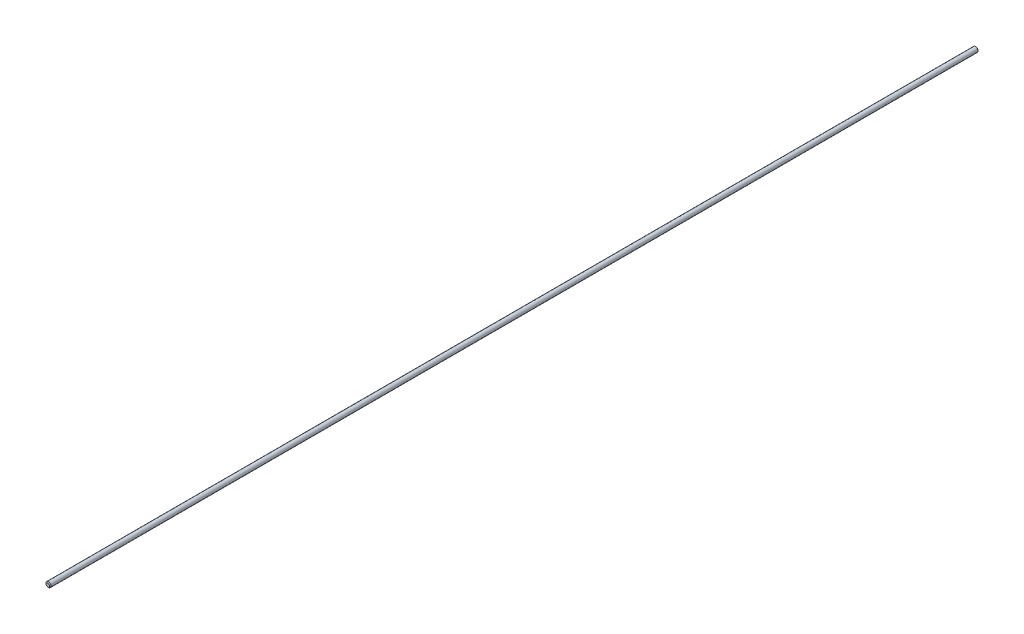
ISO-10303-21;
HEADER;
FILE_DESCRIPTION(('STEP AP214'),'2;1');
FILE_NAME('part.step','',(''),(''),'','','');
FILE_SCHEMA(('AUTOMOTIVE_DESIGN { 1 0 10303 214 1 1 1 1 }'));
ENDSEC;
DATA;
#1=APPLICATION_CONTEXT('core data for automotive mechanical design processes');
#2=APPLICATION_PROTOCOL_DEFINITION('international standard','automotive_design',2000,#1);
#3=PRODUCT_CONTEXT('',#1,'mechanical');
#4=PRODUCT('Part','Part','',(#3));
#5=PRODUCT_RELATED_PRODUCT_CATEGORY('part','',(#4));
#6=PRODUCT_DEFINITION_FORMATION('','',#4);
#7=PRODUCT_DEFINITION_CONTEXT('part definition',#1,'design');
#8=PRODUCT_DEFINITION('design','',#6,#7);
#9=PRODUCT_DEFINITION_SHAPE('','',#8);
#10=(LENGTH_UNIT() NAMED_UNIT(*) SI_UNIT(.MILLI.,.METRE.));
#11=(NAMED_UNIT(*) PLANE_ANGLE_UNIT() SI_UNIT($,.RADIAN.));
#12=(NAMED_UNIT(*) SI_UNIT($,.STERADIAN.) SOLID_ANGLE_UNIT());
#13=UNCERTAINTY_MEASURE_WITH_UNIT(LENGTH_MEASURE(1.E-05),#10,'distance_accuracy_value','');
#14=(GEOMETRIC_REPRESENTATION_CONTEXT(3) GLOBAL_UNCERTAINTY_ASSIGNED_CONTEXT((#13)) GLOBAL_UNIT_ASSIGNED_CONTEXT((#10,
#11,#12)) REPRESENTATION_CONTEXT('',''));
#15=CARTESIAN_POINT('',(0.,0.,0.));
#16=DIRECTION('',(0.,0.,1.));
#17=DIRECTION('',(1.,0.,0.));
#18=AXIS2_PLACEMENT_3D('',#15,#16,#17);
#19=CARTESIAN_POINT('',(0.,0.,584.2));
#20=DIRECTION('',(0.,0.,-1.));
#21=DIRECTION('',(-1.,0.,0.));
#22=AXIS2_PLACEMENT_3D('',#19,#20,#21);
#23=CYLINDRICAL_SURFACE('',#22,3.175);
#24=CARTESIAN_POINT('',(0.,0.,-583.2475));
#25=DIRECTION('',(0.,0.,1.));
#26=DIRECTION('',(1.,0.,0.));
#27=AXIS2_PLACEMENT_3D('',#24,#25,#26);
#28=CIRCLE('',#27,3.175);
#29=CARTESIAN_POINT('',(3.17499999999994,0.,-583.2475));
#30=VERTEX_POINT('',#29);
#31=EDGE_CURVE('E59',#30,#30,#28,.T.);
#32=ORIENTED_EDGE('',*,*,#31,.T.);
#33=EDGE_LOOP('',(#32));
#34=FACE_BOUND('',#33,.T.);
#35=CARTESIAN_POINT('',(0.,0.,583.2475));
#36=DIRECTION('',(0.,0.,1.));
#37=DIRECTION('',(1.,0.,0.));
#38=AXIS2_PLACEMENT_3D('',#35,#36,#37);
#39=CIRCLE('',#38,3.175);
#40=CARTESIAN_POINT('',(3.175,0.,583.2475));
#41=VERTEX_POINT('',#40);
#42=EDGE_CURVE('E62',#41,#41,#39,.F.);
#43=ORIENTED_EDGE('',*,*,#42,.T.);
#44=EDGE_LOOP('',(#43));
#45=FACE_BOUND('',#44,.T.);
#46=ADVANCED_FACE('F44',(#34,#45),#23,.T.);
#47=CARTESIAN_POINT('',(0.,0.,584.2));
#48=DIRECTION('',(0.,0.,1.));
#49=DIRECTION('',(1.,0.,0.));
#50=AXIS2_PLACEMENT_3D('',#47,#48,#49);
#51=PLANE('',#50);
#52=CARTESIAN_POINT('',(0.,0.,584.2));
#53=DIRECTION('',(0.,0.,1.));
#54=DIRECTION('',(1.,0.,0.));
#55=AXIS2_PLACEMENT_3D('',#52,#53,#54);
#56=CIRCLE('',#55,2.22249999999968);
#57=CARTESIAN_POINT('',(2.22249999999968,0.,584.2));
#58=VERTEX_POINT('',#57);
#59=EDGE_CURVE('E10',#58,#58,#56,.T.);
#60=ORIENTED_EDGE('',*,*,#59,.T.);
#61=EDGE_LOOP('',(#60));
#62=FACE_BOUND('',#61,.T.);
#63=ADVANCED_FACE('F78',(#62),#51,.T.);
#64=CARTESIAN_POINT('',(0.,0.,-584.2));
#65=DIRECTION('',(0.,0.,1.));
#66=DIRECTION('',(1.,0.,0.));
#67=AXIS2_PLACEMENT_3D('',#64,#65,#66);
#68=PLANE('',#67);
#69=CARTESIAN_POINT('',(0.,0.,-584.2));
#70=DIRECTION('',(0.,0.,1.));
#71=DIRECTION('',(1.,0.,0.));
#72=AXIS2_PLACEMENT_3D('',#69,#70,#71);
#73=CIRCLE('',#72,2.22249999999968);
#74=CARTESIAN_POINT('',(2.22249999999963,0.,-584.2));
#75=VERTEX_POINT('',#74);
#76=EDGE_CURVE('E52',#75,#75,#73,.F.);
#77=ORIENTED_EDGE('',*,*,#76,.T.);
#78=EDGE_LOOP('',(#77));
#79=FACE_BOUND('',#78,.T.);
#80=ADVANCED_FACE('F80',(#79),#68,.F.);
#81=CARTESIAN_POINT('',(0.,0.,-583.2475));
#82=DIRECTION('',(0.,0.,1.));
#83=DIRECTION('',(1.,0.,0.));
#84=AXIS2_PLACEMENT_3D('',#81,#82,#83);
#85=CONICAL_SURFACE('',#84,3.175,0.785398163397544);
#86=CARTESIAN_POINT('',(2.22249999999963,0.,-584.2));
#87=CARTESIAN_POINT('',(2.23242187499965,0.,-584.190078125));
#88=CARTESIAN_POINT('',(2.24234374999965,0.,-584.18015625));
#89=CARTESIAN_POINT('',(2.26218749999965,0.,-584.1603125));
#90=CARTESIAN_POINT('',(2.27210937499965,0.,-584.150390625));
#91=CARTESIAN_POINT('',(2.29195312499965,0.,-584.130546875));
#92=CARTESIAN_POINT('',(2.30187499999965,0.,-584.120625));
#93=CARTESIAN_POINT('',(2.32171874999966,0.,-584.10078125));
#94=CARTESIAN_POINT('',(2.33164062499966,0.,-584.090859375));
#95=CARTESIAN_POINT('',(2.35148437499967,0.,-584.071015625));
#96=CARTESIAN_POINT('',(2.36140624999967,0.,-584.06109375));
#97=CARTESIAN_POINT('',(2.38124999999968,0.,-584.04125));
#98=CARTESIAN_POINT('',(2.39117187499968,0.,-584.031328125));
#99=CARTESIAN_POINT('',(2.41101562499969,0.,-584.011484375));
#100=CARTESIAN_POINT('',(2.42093749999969,0.,-584.0015625));
#101=CARTESIAN_POINT('',(2.4407812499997,0.,-583.98171875));
#102=CARTESIAN_POINT('',(2.4507031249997,0.,-583.971796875));
#103=CARTESIAN_POINT('',(2.47054687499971,0.,-583.951953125));
#104=CARTESIAN_POINT('',(2.48046874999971,0.,-583.94203125));
#105=CARTESIAN_POINT('',(2.50031249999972,0.,-583.9221875));
#106=CARTESIAN_POINT('',(2.51023437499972,0.,-583.912265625));
#107=CARTESIAN_POINT('',(2.53007812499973,0.,-583.892421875));
#108=CARTESIAN_POINT('',(2.53999999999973,0.,-583.8825));
#109=CARTESIAN_POINT('',(2.55984374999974,0.,-583.86265625));
#110=CARTESIAN_POINT('',(2.56976562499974,0.,-583.852734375));
#111=CARTESIAN_POINT('',(2.58960937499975,0.,-583.832890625));
#112=CARTESIAN_POINT('',(2.59953124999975,0.,-583.82296875));
#113=CARTESIAN_POINT('',(2.61937499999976,0.,-583.803125));
#114=CARTESIAN_POINT('',(2.62929687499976,0.,-583.793203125));
#115=CARTESIAN_POINT('',(2.64914062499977,0.,-583.773359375));
#116=CARTESIAN_POINT('',(2.65906249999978,0.,-583.7634375));
#117=CARTESIAN_POINT('',(2.67890624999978,0.,-583.74359375));
#118=CARTESIAN_POINT('',(2.68882812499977,0.,-583.733671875));
#119=CARTESIAN_POINT('',(2.70867187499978,0.,-583.713828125));
#120=CARTESIAN_POINT('',(2.7185937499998,0.,-583.70390625));
#121=CARTESIAN_POINT('',(2.73843749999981,0.,-583.6840625));
#122=CARTESIAN_POINT('',(2.74835937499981,0.,-583.674140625));
#123=CARTESIAN_POINT('',(2.76820312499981,0.,-583.654296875));
#124=CARTESIAN_POINT('',(2.77812499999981,0.,-583.644375));
#125=CARTESIAN_POINT('',(2.79796874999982,0.,-583.62453125));
#126=CARTESIAN_POINT('',(2.80789062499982,0.,-583.614609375));
#127=CARTESIAN_POINT('',(2.82773437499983,0.,-583.594765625));
#128=CARTESIAN_POINT('',(2.83765624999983,0.,-583.58484375));
#129=CARTESIAN_POINT('',(2.85749999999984,0.,-583.565));
#130=CARTESIAN_POINT('',(2.86742187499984,0.,-583.555078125));
#131=CARTESIAN_POINT('',(2.88726562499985,0.,-583.535234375));
#132=CARTESIAN_POINT('',(2.89718749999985,0.,-583.5253125));
#133=CARTESIAN_POINT('',(2.91703124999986,0.,-583.50546875));
#134=CARTESIAN_POINT('',(2.92695312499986,0.,-583.495546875));
#135=CARTESIAN_POINT('',(2.94679687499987,0.,-583.475703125));
#136=CARTESIAN_POINT('',(2.95671874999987,0.,-583.46578125));
#137=CARTESIAN_POINT('',(2.97656249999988,0.,-583.4459375));
#138=CARTESIAN_POINT('',(2.98648437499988,0.,-583.436015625));
#139=CARTESIAN_POINT('',(3.00632812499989,0.,-583.416171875));
#140=CARTESIAN_POINT('',(3.01624999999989,0.,-583.40625));
#141=CARTESIAN_POINT('',(3.0360937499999,0.,-583.38640625));
#142=CARTESIAN_POINT('',(3.0460156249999,0.,-583.376484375));
#143=CARTESIAN_POINT('',(3.06585937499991,0.,-583.356640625));
#144=CARTESIAN_POINT('',(3.07578124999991,0.,-583.34671875));
#145=CARTESIAN_POINT('',(3.09562499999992,0.,-583.326875));
#146=CARTESIAN_POINT('',(3.10554687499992,0.,-583.316953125));
#147=CARTESIAN_POINT('',(3.12539062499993,0.,-583.297109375));
#148=CARTESIAN_POINT('',(3.13531249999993,0.,-583.2871875));
#149=CARTESIAN_POINT('',(3.15515624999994,0.,-583.26734375));
#150=CARTESIAN_POINT('',(3.16507812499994,0.,-583.257421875));
#151=CARTESIAN_POINT('',(3.17499999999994,0.,-583.2475));
#152=B_SPLINE_CURVE_WITH_KNOTS('',3,(#86,#87,#88,#89,#90,#91,#92,#93,#94,#95,#96,#97,#98,#99,
#100,#101,#102,#103,#104,#105,#106,#107,#108,#109,#110,#111,#112,#113,#114,#115,#116,#117,#118,
#119,#120,#121,#122,#123,#124,#125,#126,#127,#128,#129,#130,#131,#132,#133,#134,#135,#136,#137,
#138,#139,#140,#141,#142,#143,#144,#145,#146,#147,#148,#149,#150,#151),.UNSPECIFIED.,.F.,.F.,(4,
2,2,2,2,2,2,2,2,2,2,2,2,2,2,2,2,2,2,2,2,2,2,2,2,2,2,2,2,2,2,2,4),(0.,0.042094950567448,
0.0841899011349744,0.126284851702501,0.168379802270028,0.210474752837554,0.252569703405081,
0.294664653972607,0.336759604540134,0.37885455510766,0.420949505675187,0.463044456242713,
0.50513940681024,0.547234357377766,0.589329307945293,0.631424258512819,0.673519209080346,
0.715614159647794,0.757709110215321,0.799804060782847,0.841899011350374,0.8839939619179,
0.926088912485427,0.968183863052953,1.01027881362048,1.05237376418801,1.09446871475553,
1.13656366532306,1.17865861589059,1.22075356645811,1.26284851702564,1.30494346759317,
1.34703841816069),.UNSPECIFIED.);
#153=EDGE_CURVE('BSEAM74',#75,#30,#152,.T.);
#154=ORIENTED_EDGE('',*,*,#76,.F.);
#155=ORIENTED_EDGE('',*,*,#31,.F.);
#156=ORIENTED_EDGE('',*,*,#153,.T.);
#157=ORIENTED_EDGE('',*,*,#153,.F.);
#158=EDGE_LOOP('',(#154,#156,#155,#157));
#159=FACE_BOUND('',#158,.T.);
#160=ADVANCED_FACE('F74',(#159),#85,.T.);
#161=CARTESIAN_POINT('',(0.,0.,584.2));
#162=DIRECTION('',(0.,0.,-1.));
#163=DIRECTION('',(-1.,0.,0.));
#164=AXIS2_PLACEMENT_3D('',#161,#162,#163);
#165=CONICAL_SURFACE('',#164,2.22249999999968,0.785398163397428);
#166=ORIENTED_EDGE('',*,*,#42,.F.);
#167=EDGE_LOOP('',(#166));
#168=FACE_BOUND('',#167,.T.);
#169=ORIENTED_EDGE('',*,*,#59,.F.);
#170=EDGE_LOOP('',(#169));
#171=FACE_BOUND('',#170,.T.);
#172=ADVANCED_FACE('F50',(#168,#171),#165,.T.);
#173=CLOSED_SHELL('',(#46,#63,#80,#160,#172));
#174=MANIFOLD_SOLID_BREP('B2',#173);
#175=ADVANCED_BREP_SHAPE_REPRESENTATION('',(#18,#174),#14);
#176=SHAPE_DEFINITION_REPRESENTATION(#9,#175);
ENDSEC;
END-ISO-10303-21;
